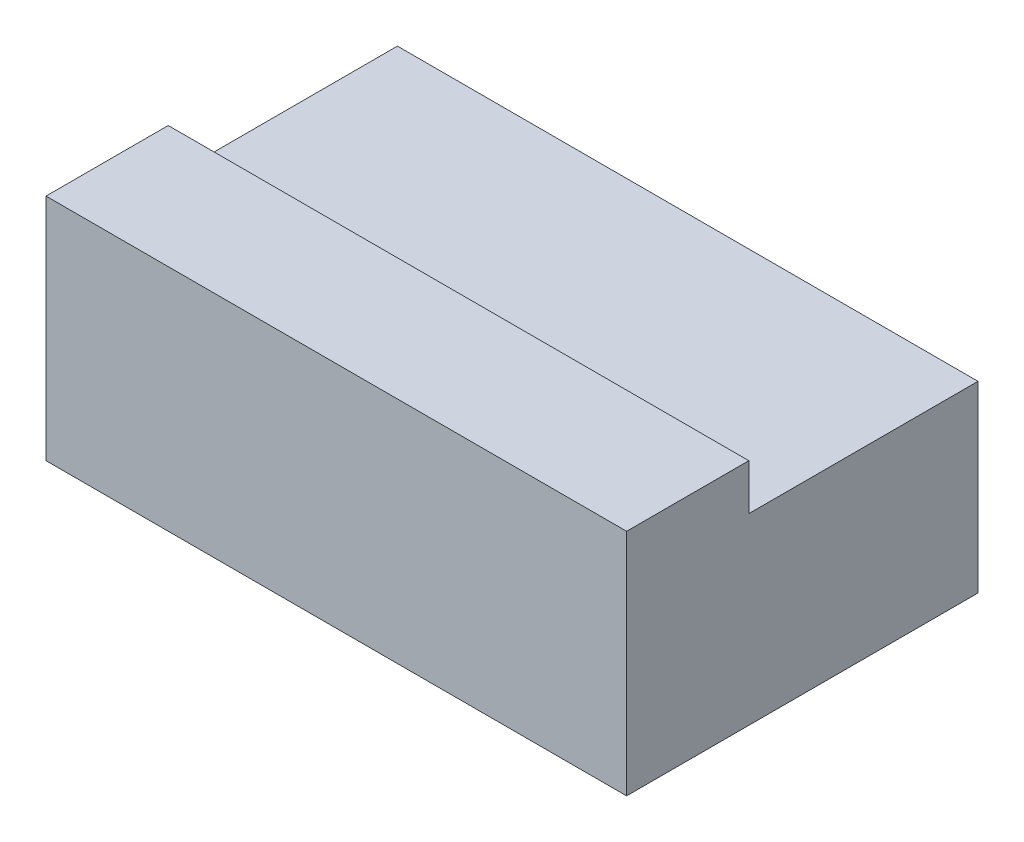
ISO-10303-21;
HEADER;
FILE_DESCRIPTION(('STEP AP214'),'2;1');
FILE_NAME('part.step','',(''),(''),'','','');
FILE_SCHEMA(('AUTOMOTIVE_DESIGN { 1 0 10303 214 1 1 1 1 }'));
ENDSEC;
DATA;
#1=APPLICATION_CONTEXT('core data for automotive mechanical design processes');
#2=APPLICATION_PROTOCOL_DEFINITION('international standard','automotive_design',2000,#1);
#3=PRODUCT_CONTEXT('',#1,'mechanical');
#4=PRODUCT('Part','Part','',(#3));
#5=PRODUCT_RELATED_PRODUCT_CATEGORY('part','',(#4));
#6=PRODUCT_DEFINITION_FORMATION('','',#4);
#7=PRODUCT_DEFINITION_CONTEXT('part definition',#1,'design');
#8=PRODUCT_DEFINITION('design','',#6,#7);
#9=PRODUCT_DEFINITION_SHAPE('','',#8);
#10=(LENGTH_UNIT() NAMED_UNIT(*) SI_UNIT(.MILLI.,.METRE.));
#11=(NAMED_UNIT(*) PLANE_ANGLE_UNIT() SI_UNIT($,.RADIAN.));
#12=(NAMED_UNIT(*) SI_UNIT($,.STERADIAN.) SOLID_ANGLE_UNIT());
#13=UNCERTAINTY_MEASURE_WITH_UNIT(LENGTH_MEASURE(1.E-05),#10,'distance_accuracy_value','');
#14=(GEOMETRIC_REPRESENTATION_CONTEXT(3) GLOBAL_UNCERTAINTY_ASSIGNED_CONTEXT((#13)) GLOBAL_UNIT_ASSIGNED_CONTEXT((#10,
#11,#12)) REPRESENTATION_CONTEXT('',''));
#15=CARTESIAN_POINT('',(0.,0.,0.));
#16=DIRECTION('',(0.,0.,1.));
#17=DIRECTION('',(1.,0.,0.));
#18=AXIS2_PLACEMENT_3D('',#15,#16,#17);
#19=CARTESIAN_POINT('',(-95.,37.5,-57.5));
#20=DIRECTION('',(0.,0.,1.));
#21=DIRECTION('',(1.,0.,0.));
#22=AXIS2_PLACEMENT_3D('',#19,#20,#21);
#23=PLANE('',#22);
#24=DIRECTION('',(-1.,0.,0.));
#25=VECTOR('',#24,1.);
#26=CARTESIAN_POINT('',(-95.,22.5,-57.5));
#27=LINE('',#26,#25);
#28=CARTESIAN_POINT('',(95.,22.5,-57.5));
#29=VERTEX_POINT('',#28);
#30=CARTESIAN_POINT('',(-95.,22.5,-57.5));
#31=VERTEX_POINT('',#30);
#32=EDGE_CURVE('E133',#29,#31,#27,.T.);
#33=ORIENTED_EDGE('',*,*,#32,.F.);
#34=DIRECTION('',(0.,-1.,0.));
#35=VECTOR('',#34,1.);
#36=CARTESIAN_POINT('',(95.,37.5,-57.5));
#37=LINE('',#36,#35);
#38=CARTESIAN_POINT('',(95.,-37.5,-57.5));
#39=VERTEX_POINT('',#38);
#40=EDGE_CURVE('E11',#29,#39,#37,.T.);
#41=ORIENTED_EDGE('',*,*,#40,.T.);
#42=DIRECTION('',(-1.,0.,0.));
#43=VECTOR('',#42,1.);
#44=CARTESIAN_POINT('',(-95.,-37.5,-57.5));
#45=LINE('',#44,#43);
#46=CARTESIAN_POINT('',(-95.,-37.5,-57.5));
#47=VERTEX_POINT('',#46);
#48=EDGE_CURVE('E107',#39,#47,#45,.T.);
#49=ORIENTED_EDGE('',*,*,#48,.T.);
#50=DIRECTION('',(0.,-1.,0.));
#51=VECTOR('',#50,1.);
#52=CARTESIAN_POINT('',(-95.,37.5,-57.5));
#53=LINE('',#52,#51);
#54=EDGE_CURVE('E48',#31,#47,#53,.T.);
#55=ORIENTED_EDGE('',*,*,#54,.F.);
#56=EDGE_LOOP('',(#33,#41,#49,#55));
#57=FACE_BOUND('',#56,.T.);
#58=ADVANCED_FACE('F39',(#57),#23,.F.);
#59=CARTESIAN_POINT('',(95.,37.5,-57.5));
#60=DIRECTION('',(-1.,0.,0.));
#61=DIRECTION('',(0.,0.,1.));
#62=AXIS2_PLACEMENT_3D('',#59,#60,#61);
#63=PLANE('',#62);
#64=DIRECTION('',(0.,0.,-1.));
#65=VECTOR('',#64,1.);
#66=CARTESIAN_POINT('',(95.,22.5,-57.5));
#67=LINE('',#66,#65);
#68=CARTESIAN_POINT('',(95.,22.5,17.5));
#69=VERTEX_POINT('',#68);
#70=EDGE_CURVE('E136',#69,#29,#67,.T.);
#71=ORIENTED_EDGE('',*,*,#70,.F.);
#72=DIRECTION('',(0.,1.,0.));
#73=VECTOR('',#72,1.);
#74=CARTESIAN_POINT('',(95.,22.5,17.5));
#75=LINE('',#74,#73);
#76=CARTESIAN_POINT('',(95.,37.5,17.5));
#77=VERTEX_POINT('',#76);
#78=EDGE_CURVE('E109',#69,#77,#75,.T.);
#79=ORIENTED_EDGE('',*,*,#78,.T.);
#80=DIRECTION('',(0.,0.,-1.));
#81=VECTOR('',#80,1.);
#82=CARTESIAN_POINT('',(95.,37.5,-57.5));
#83=LINE('',#82,#81);
#84=CARTESIAN_POINT('',(95.,37.5,57.5));
#85=VERTEX_POINT('',#84);
#86=EDGE_CURVE('E93',#85,#77,#83,.T.);
#87=ORIENTED_EDGE('',*,*,#86,.F.);
#88=DIRECTION('',(0.,-1.,0.));
#89=VECTOR('',#88,1.);
#90=CARTESIAN_POINT('',(95.,37.5,57.5));
#91=LINE('',#90,#89);
#92=CARTESIAN_POINT('',(95.,-37.5,57.5));
#93=VERTEX_POINT('',#92);
#94=EDGE_CURVE('E85',#85,#93,#91,.T.);
#95=ORIENTED_EDGE('',*,*,#94,.T.);
#96=DIRECTION('',(0.,0.,-1.));
#97=VECTOR('',#96,1.);
#98=CARTESIAN_POINT('',(95.,-37.5,-57.5));
#99=LINE('',#98,#97);
#100=EDGE_CURVE('E100',#93,#39,#99,.T.);
#101=ORIENTED_EDGE('',*,*,#100,.T.);
#102=ORIENTED_EDGE('',*,*,#40,.F.);
#103=EDGE_LOOP('',(#71,#79,#87,#95,#101,#102));
#104=FACE_BOUND('',#103,.T.);
#105=ADVANCED_FACE('F41',(#104),#63,.F.);
#106=CARTESIAN_POINT('',(-95.,37.5,-57.5));
#107=DIRECTION('',(1.,0.,0.));
#108=DIRECTION('',(0.,0.,-1.));
#109=AXIS2_PLACEMENT_3D('',#106,#107,#108);
#110=PLANE('',#109);
#111=DIRECTION('',(0.,0.,1.));
#112=VECTOR('',#111,1.);
#113=CARTESIAN_POINT('',(-95.,37.5,-57.5));
#114=LINE('',#113,#112);
#115=CARTESIAN_POINT('',(-95.,37.5,17.5));
#116=VERTEX_POINT('',#115);
#117=CARTESIAN_POINT('',(-95.,37.5,57.5));
#118=VERTEX_POINT('',#117);
#119=EDGE_CURVE('E154',#116,#118,#114,.T.);
#120=ORIENTED_EDGE('',*,*,#119,.F.);
#121=DIRECTION('',(0.,1.,0.));
#122=VECTOR('',#121,1.);
#123=CARTESIAN_POINT('',(-95.,22.5,17.5));
#124=LINE('',#123,#122);
#125=CARTESIAN_POINT('',(-95.,22.5,17.5));
#126=VERTEX_POINT('',#125);
#127=EDGE_CURVE('E55',#126,#116,#124,.T.);
#128=ORIENTED_EDGE('',*,*,#127,.F.);
#129=DIRECTION('',(0.,0.,1.));
#130=VECTOR('',#129,1.);
#131=CARTESIAN_POINT('',(-95.,22.5,-57.5));
#132=LINE('',#131,#130);
#133=EDGE_CURVE('E128',#31,#126,#132,.T.);
#134=ORIENTED_EDGE('',*,*,#133,.F.);
#135=ORIENTED_EDGE('',*,*,#54,.T.);
#136=DIRECTION('',(0.,0.,1.));
#137=VECTOR('',#136,1.);
#138=CARTESIAN_POINT('',(-95.,-37.5,-57.5));
#139=LINE('',#138,#137);
#140=CARTESIAN_POINT('',(-95.,-37.5,57.5));
#141=VERTEX_POINT('',#140);
#142=EDGE_CURVE('E94',#47,#141,#139,.T.);
#143=ORIENTED_EDGE('',*,*,#142,.T.);
#144=DIRECTION('',(0.,-1.,0.));
#145=VECTOR('',#144,1.);
#146=CARTESIAN_POINT('',(-95.,37.5,57.5));
#147=LINE('',#146,#145);
#148=EDGE_CURVE('E88',#118,#141,#147,.T.);
#149=ORIENTED_EDGE('',*,*,#148,.F.);
#150=EDGE_LOOP('',(#120,#128,#134,#135,#143,#149));
#151=FACE_BOUND('',#150,.T.);
#152=ADVANCED_FACE('F126',(#151),#110,.F.);
#153=CARTESIAN_POINT('',(-95.,37.5,57.5));
#154=DIRECTION('',(0.,0.,-1.));
#155=DIRECTION('',(-1.,0.,0.));
#156=AXIS2_PLACEMENT_3D('',#153,#154,#155);
#157=PLANE('',#156);
#158=DIRECTION('',(1.,0.,0.));
#159=VECTOR('',#158,1.);
#160=CARTESIAN_POINT('',(-95.,-37.5,57.5));
#161=LINE('',#160,#159);
#162=EDGE_CURVE('E82',#141,#93,#161,.T.);
#163=ORIENTED_EDGE('',*,*,#162,.T.);
#164=ORIENTED_EDGE('',*,*,#94,.F.);
#165=DIRECTION('',(1.,0.,0.));
#166=VECTOR('',#165,1.);
#167=CARTESIAN_POINT('',(-95.,37.5,57.5));
#168=LINE('',#167,#166);
#169=EDGE_CURVE('E64',#118,#85,#168,.T.);
#170=ORIENTED_EDGE('',*,*,#169,.F.);
#171=ORIENTED_EDGE('',*,*,#148,.T.);
#172=EDGE_LOOP('',(#163,#164,#170,#171));
#173=FACE_BOUND('',#172,.T.);
#174=ADVANCED_FACE('F84',(#173),#157,.F.);
#175=CARTESIAN_POINT('',(0.,37.5,0.));
#176=DIRECTION('',(0.,1.,0.));
#177=DIRECTION('',(0.,0.,1.));
#178=AXIS2_PLACEMENT_3D('',#175,#176,#177);
#179=PLANE('',#178);
#180=DIRECTION('',(1.,0.,0.));
#181=VECTOR('',#180,1.);
#182=CARTESIAN_POINT('',(-95.,37.5,17.5));
#183=LINE('',#182,#181);
#184=EDGE_CURVE('E146',#116,#77,#183,.T.);
#185=ORIENTED_EDGE('',*,*,#184,.F.);
#186=ORIENTED_EDGE('',*,*,#119,.T.);
#187=ORIENTED_EDGE('',*,*,#169,.T.);
#188=ORIENTED_EDGE('',*,*,#86,.T.);
#189=EDGE_LOOP('',(#185,#186,#187,#188));
#190=FACE_BOUND('',#189,.T.);
#191=ADVANCED_FACE('F164',(#190),#179,.T.);
#192=CARTESIAN_POINT('',(0.,-37.5,0.));
#193=DIRECTION('',(0.,1.,0.));
#194=DIRECTION('',(0.,0.,1.));
#195=AXIS2_PLACEMENT_3D('',#192,#193,#194);
#196=PLANE('',#195);
#197=ORIENTED_EDGE('',*,*,#100,.F.);
#198=ORIENTED_EDGE('',*,*,#162,.F.);
#199=ORIENTED_EDGE('',*,*,#142,.F.);
#200=ORIENTED_EDGE('',*,*,#48,.F.);
#201=EDGE_LOOP('',(#197,#198,#199,#200));
#202=FACE_BOUND('',#201,.T.);
#203=ADVANCED_FACE('F105',(#202),#196,.F.);
#204=CARTESIAN_POINT('',(-95.,22.5,17.5));
#205=DIRECTION('',(0.,0.,1.));
#206=DIRECTION('',(1.,0.,0.));
#207=AXIS2_PLACEMENT_3D('',#204,#205,#206);
#208=PLANE('',#207);
#209=ORIENTED_EDGE('',*,*,#184,.T.);
#210=ORIENTED_EDGE('',*,*,#78,.F.);
#211=DIRECTION('',(1.,0.,0.));
#212=VECTOR('',#211,1.);
#213=CARTESIAN_POINT('',(-95.,22.5,17.5));
#214=LINE('',#213,#212);
#215=EDGE_CURVE('E147',#126,#69,#214,.T.);
#216=ORIENTED_EDGE('',*,*,#215,.F.);
#217=ORIENTED_EDGE('',*,*,#127,.T.);
#218=EDGE_LOOP('',(#209,#210,#216,#217));
#219=FACE_BOUND('',#218,.T.);
#220=ADVANCED_FACE('F148',(#219),#208,.F.);
#221=CARTESIAN_POINT('',(0.,22.5,0.));
#222=DIRECTION('',(0.,1.,0.));
#223=DIRECTION('',(0.,0.,1.));
#224=AXIS2_PLACEMENT_3D('',#221,#222,#223);
#225=PLANE('',#224);
#226=ORIENTED_EDGE('',*,*,#133,.T.);
#227=ORIENTED_EDGE('',*,*,#215,.T.);
#228=ORIENTED_EDGE('',*,*,#70,.T.);
#229=ORIENTED_EDGE('',*,*,#32,.T.);
#230=EDGE_LOOP('',(#226,#227,#228,#229));
#231=FACE_BOUND('',#230,.T.);
#232=ADVANCED_FACE('F151',(#231),#225,.T.);
#233=CLOSED_SHELL('',(#58,#105,#152,#174,#191,#203,#220,#232));
#234=MANIFOLD_SOLID_BREP('B2',#233);
#235=ADVANCED_BREP_SHAPE_REPRESENTATION('',(#18,#234),#14);
#236=SHAPE_DEFINITION_REPRESENTATION(#9,#235);
ENDSEC;
END-ISO-10303-21;
